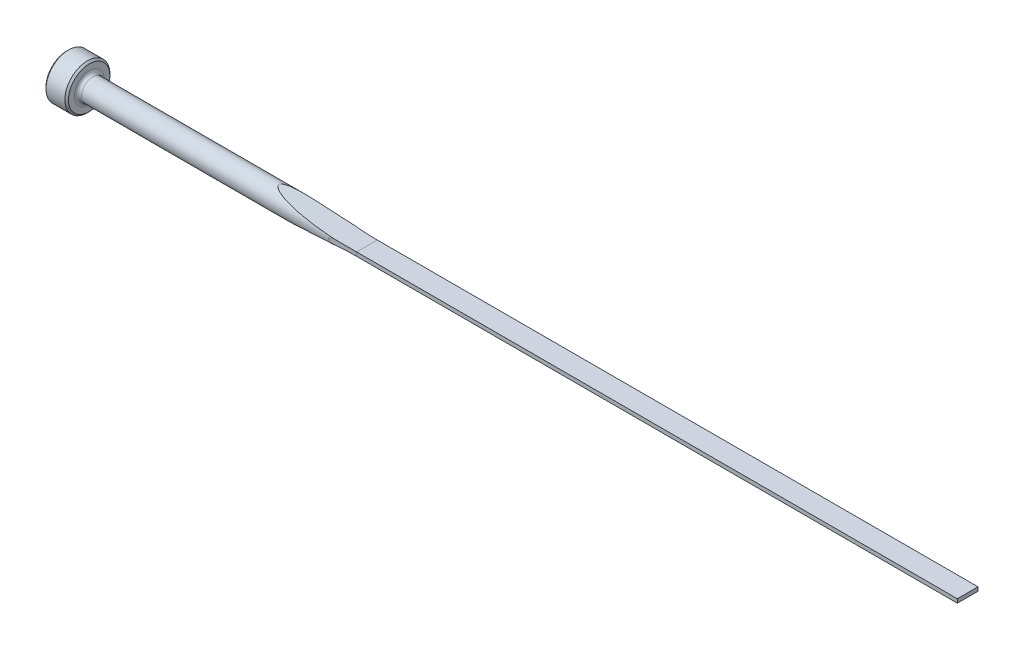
ISO-10303-21;
HEADER;
FILE_DESCRIPTION(('STEP AP214'),'2;1');
FILE_NAME('part.step','',(''),(''),'','','');
FILE_SCHEMA(('AUTOMOTIVE_DESIGN { 1 0 10303 214 1 1 1 1 }'));
ENDSEC;
DATA;
#1=APPLICATION_CONTEXT('core data for automotive mechanical design processes');
#2=APPLICATION_PROTOCOL_DEFINITION('international standard','automotive_design',2000,#1);
#3=PRODUCT_CONTEXT('',#1,'mechanical');
#4=PRODUCT('Part','Part','',(#3));
#5=PRODUCT_RELATED_PRODUCT_CATEGORY('part','',(#4));
#6=PRODUCT_DEFINITION_FORMATION('','',#4);
#7=PRODUCT_DEFINITION_CONTEXT('part definition',#1,'design');
#8=PRODUCT_DEFINITION('design','',#6,#7);
#9=PRODUCT_DEFINITION_SHAPE('','',#8);
#10=(LENGTH_UNIT() NAMED_UNIT(*) SI_UNIT(.MILLI.,.METRE.));
#11=(NAMED_UNIT(*) PLANE_ANGLE_UNIT() SI_UNIT($,.RADIAN.));
#12=(NAMED_UNIT(*) SI_UNIT($,.STERADIAN.) SOLID_ANGLE_UNIT());
#13=UNCERTAINTY_MEASURE_WITH_UNIT(LENGTH_MEASURE(1.E-05),#10,'distance_accuracy_value','');
#14=(GEOMETRIC_REPRESENTATION_CONTEXT(3) GLOBAL_UNCERTAINTY_ASSIGNED_CONTEXT((#13)) GLOBAL_UNIT_ASSIGNED_CONTEXT((#10,
#11,#12)) REPRESENTATION_CONTEXT('',''));
#15=CARTESIAN_POINT('',(0.,0.,0.));
#16=DIRECTION('',(0.,0.,1.));
#17=DIRECTION('',(1.,0.,0.));
#18=AXIS2_PLACEMENT_3D('',#15,#16,#17);
#19=CARTESIAN_POINT('',(0.,0.,0.));
#20=DIRECTION('',(-1.,0.,0.));
#21=DIRECTION('',(0.,0.,1.));
#22=AXIS2_PLACEMENT_3D('',#19,#20,#21);
#23=CYLINDRICAL_SURFACE('',#22,2.3749);
#24=CARTESIAN_POINT('',(5.5118,0.,0.));
#25=DIRECTION('',(-1.,0.,0.));
#26=DIRECTION('',(0.,0.,1.));
#27=AXIS2_PLACEMENT_3D('',#24,#25,#26);
#28=CIRCLE('',#27,2.3749);
#29=CARTESIAN_POINT('',(5.5118,0.,2.3749));
#30=VERTEX_POINT('',#29);
#31=EDGE_CURVE('E164',#30,#30,#28,.F.);
#32=ORIENTED_EDGE('',*,*,#31,.T.);
#33=EDGE_LOOP('',(#32));
#34=FACE_BOUND('',#33,.T.);
#35=CARTESIAN_POINT('',(63.5,0.931958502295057,2.18439999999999));
#36=CARTESIAN_POINT('',(63.3075515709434,0.931940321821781,2.18439976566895));
#37=CARTESIAN_POINT('',(63.1151013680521,0.930492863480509,2.18502490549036));
#38=CARTESIAN_POINT('',(62.7302234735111,0.92461137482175,2.18752450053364));
#39=CARTESIAN_POINT('',(62.5377957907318,0.920176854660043,2.18939916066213));
#40=CARTESIAN_POINT('',(62.1518341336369,0.908155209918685,2.19441218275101));
#41=CARTESIAN_POINT('',(61.9583008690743,0.900548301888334,2.19755847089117));
#42=CARTESIAN_POINT('',(61.5714442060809,0.881895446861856,2.20511052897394));
#43=CARTESIAN_POINT('',(61.3781207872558,0.870849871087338,2.20951616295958));
#44=CARTESIAN_POINT('',(60.9803005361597,0.844100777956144,2.21987943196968));
#45=CARTESIAN_POINT('',(60.7758212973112,0.828159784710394,2.2259136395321));
#46=CARTESIAN_POINT('',(60.3673129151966,0.791030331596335,2.23937732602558));
#47=CARTESIAN_POINT('',(60.1632839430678,0.769840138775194,2.24680726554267));
#48=CARTESIAN_POINT('',(59.75661740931,0.720830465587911,2.26301546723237));
#49=CARTESIAN_POINT('',(59.5539775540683,0.693029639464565,2.27178991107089));
#50=CARTESIAN_POINT('',(59.2512709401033,0.644172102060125,2.28592867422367));
#51=CARTESIAN_POINT('',(59.150603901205,0.626699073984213,2.29080303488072));
#52=CARTESIAN_POINT('',(58.9498678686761,0.588702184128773,2.30086330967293));
#53=CARTESIAN_POINT('',(58.8497987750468,0.568178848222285,2.30604917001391));
#54=CARTESIAN_POINT('',(58.7018199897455,0.534634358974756,2.31396676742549));
#55=CARTESIAN_POINT('',(58.6535509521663,0.523182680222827,2.3165891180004));
#56=CARTESIAN_POINT('',(58.5573085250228,0.499097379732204,2.32189592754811));
#57=CARTESIAN_POINT('',(58.5093351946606,0.486463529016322,2.32458039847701));
#58=CARTESIAN_POINT('',(58.3663526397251,0.446582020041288,2.33269738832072));
#59=CARTESIAN_POINT('',(58.2718724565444,0.417265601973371,2.33821536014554));
#60=CARTESIAN_POINT('',(58.1453639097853,0.370835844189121,2.34580058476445));
#61=CARTESIAN_POINT('',(58.1118331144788,0.357819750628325,2.34783049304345));
#62=CARTESIAN_POINT('',(58.0453758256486,0.330089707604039,2.35189084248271));
#63=CARTESIAN_POINT('',(58.01245087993,0.315371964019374,2.35392127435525));
#64=CARTESIAN_POINT('',(57.9466649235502,0.28318239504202,2.35801388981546));
#65=CARTESIAN_POINT('',(57.9138393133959,0.265637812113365,2.36007502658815));
#66=CARTESIAN_POINT('',(57.8503018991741,0.227094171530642,2.36409846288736));
#67=CARTESIAN_POINT('',(57.8195817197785,0.206110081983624,2.36606114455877));
#68=CARTESIAN_POINT('',(57.7807522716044,0.17363214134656,2.36855971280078));
#69=CARTESIAN_POINT('',(57.7706531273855,0.164553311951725,2.36921145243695));
#70=CARTESIAN_POINT('',(57.751335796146,0.145453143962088,2.3704611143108));
#71=CARTESIAN_POINT('',(57.7421190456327,0.135430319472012,2.3710589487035));
#72=CARTESIAN_POINT('',(57.7248924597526,0.114162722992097,2.372178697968));
#73=CARTESIAN_POINT('',(57.7168989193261,0.10290439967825,2.3726995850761));
#74=CARTESIAN_POINT('',(57.7029630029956,0.0791761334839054,2.37360916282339));
#75=CARTESIAN_POINT('',(57.6970130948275,0.0667108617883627,2.37399833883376));
#76=CARTESIAN_POINT('',(57.6895493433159,0.0451214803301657,2.37448695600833));
#77=CARTESIAN_POINT('',(57.687216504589,0.0362843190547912,2.37463982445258));
#78=CARTESIAN_POINT('',(57.684070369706,0.018342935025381,2.3748460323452));
#79=CARTESIAN_POINT('',(57.68325542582,0.00923901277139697,2.37489947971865));
#80=CARTESIAN_POINT('',(57.6832396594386,-0.00898512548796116,2.37490051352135));
#81=CARTESIAN_POINT('',(57.6840414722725,-0.0181053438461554,2.37484792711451));
#82=CARTESIAN_POINT('',(57.6871682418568,-0.0360804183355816,2.37464298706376));
#83=CARTESIAN_POINT('',(57.6894948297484,-0.0449349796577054,2.37449052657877));
#84=CARTESIAN_POINT('',(57.696426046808,-0.0650505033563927,2.37403676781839));
#85=CARTESIAN_POINT('',(57.7015301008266,-0.0761364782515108,2.37370288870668));
#86=CARTESIAN_POINT('',(57.7134090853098,-0.0973644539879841,2.37292722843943));
#87=CARTESIAN_POINT('',(57.720188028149,-0.10750410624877,2.37248518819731));
#88=CARTESIAN_POINT('',(57.7406526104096,-0.134467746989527,2.37115359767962));
#89=CARTESIAN_POINT('',(57.7555945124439,-0.150320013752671,2.37018436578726));
#90=CARTESIAN_POINT('',(57.7874630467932,-0.179846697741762,2.36812651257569));
#91=CARTESIAN_POINT('',(57.8043958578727,-0.193514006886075,2.36703752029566));
#92=CARTESIAN_POINT('',(57.8500057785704,-0.226993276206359,2.36411848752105));
#93=CARTESIAN_POINT('',(57.8796018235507,-0.245533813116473,2.36223795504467));
#94=CARTESIAN_POINT('',(57.9403493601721,-0.279898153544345,2.3584104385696));
#95=CARTESIAN_POINT('',(57.9715045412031,-0.295715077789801,2.35646330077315));
#96=CARTESIAN_POINT('',(58.0666093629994,-0.34041895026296,2.35057165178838));
#97=CARTESIAN_POINT('',(58.1319170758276,-0.366382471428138,2.34659497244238));
#98=CARTESIAN_POINT('',(58.2741782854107,-0.417382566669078,2.3380950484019));
#99=CARTESIAN_POINT('',(58.3513848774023,-0.441669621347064,2.33358126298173));
#100=CARTESIAN_POINT('',(58.506961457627,-0.486276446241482,2.32469268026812));
#101=CARTESIAN_POINT('',(58.5853319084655,-0.506594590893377,2.32031794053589));
#102=CARTESIAN_POINT('',(58.8218439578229,-0.563416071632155,2.30743335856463));
#103=CARTESIAN_POINT('',(58.9810064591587,-0.595665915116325,2.29918591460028));
#104=CARTESIAN_POINT('',(59.3005735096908,-0.653182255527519,2.28349651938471));
#105=CARTESIAN_POINT('',(59.46097818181,-0.678448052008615,2.27605464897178));
#106=CARTESIAN_POINT('',(59.7823165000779,-0.723854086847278,2.26202300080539));
#107=CARTESIAN_POINT('',(59.9432491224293,-0.744001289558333,2.25543207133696));
#108=CARTESIAN_POINT('',(60.3686966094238,-0.792003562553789,2.23917011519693));
#109=CARTESIAN_POINT('',(60.6336093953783,-0.816543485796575,2.23022625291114));
#110=CARTESIAN_POINT('',(61.1642384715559,-0.857758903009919,2.21469349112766));
#111=CARTESIAN_POINT('',(61.4299551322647,-0.874429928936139,2.20810593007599));
#112=CARTESIAN_POINT('',(61.9612705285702,-0.901186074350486,2.19732116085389));
#113=CARTESIAN_POINT('',(62.2268685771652,-0.911283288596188,2.19311956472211));
#114=CARTESIAN_POINT('',(62.7582486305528,-0.925643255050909,2.18709742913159));
#115=CARTESIAN_POINT('',(63.0240306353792,-0.929906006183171,2.18527689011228));
#116=CARTESIAN_POINT('',(63.3598826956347,-0.931763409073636,2.18448280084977));
#117=CARTESIAN_POINT('',(63.4299416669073,-0.931956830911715,2.18439997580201));
#118=CARTESIAN_POINT('',(63.5,-0.931958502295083,2.18439999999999));
#119=B_SPLINE_CURVE_WITH_KNOTS('',3,(#35,#36,#37,#38,#39,#40,#41,#42,#43,#44,#45,#46,#47,#48,
#49,#50,#51,#52,#53,#54,#55,#56,#57,#58,#59,#60,#61,#62,#63,#64,#65,#66,#67,#68,#69,#70,#71,#72,
#73,#74,#75,#76,#77,#78,#79,#80,#81,#82,#83,#84,#85,#86,#87,#88,#89,#90,#91,#92,#93,#94,#95,#96,
#97,#98,#99,#100,#101,#102,#103,#104,#105,#106,#107,#108,#109,#110,#111,#112,#113,#114,#115,
#116,#117,#118),.UNSPECIFIED.,.F.,.F.,(4,2,2,2,2,2,2,2,2,2,2,2,2,2,2,2,2,2,2,2,2,2,2,2,2,2,2,2,
2,2,2,2,2,2,2,2,2,2,2,2,2,4),(0.,0.577341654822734,1.15477801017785,1.73587049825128,
2.31690027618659,2.93240275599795,3.5481087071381,4.16209742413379,4.46893047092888,
4.77571068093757,4.9247288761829,5.07377599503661,5.37061535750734,5.47866452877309,
5.58695943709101,5.69870175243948,5.80997010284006,5.85071283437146,5.89152080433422,
5.93283229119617,5.97398983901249,6.00129967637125,6.02857985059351,6.05590452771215,
6.08325848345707,6.11967760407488,6.1561848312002,6.22123367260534,6.28649000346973,
6.39114062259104,6.49605180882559,6.70686384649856,6.94992813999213,7.19309177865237,
7.68061293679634,8.16818297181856,8.65508602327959,9.45349626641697,10.2523593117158,
11.0497483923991,11.8471376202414,12.0573140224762),.UNSPECIFIED.);
#120=CARTESIAN_POINT('',(58.7071074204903,0.535694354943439,2.31369435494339));
#121=VERTEX_POINT('',#120);
#122=CARTESIAN_POINT('',(58.7071074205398,-0.535694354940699,2.31369435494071));
#123=VERTEX_POINT('',#122);
#124=EDGE_CURVE('E167',#121,#123,#119,.T.);
#125=ORIENTED_EDGE('',*,*,#124,.F.);
#126=CARTESIAN_POINT('',(63.5,0.406400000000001,2.33986945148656));
#127=CARTESIAN_POINT('',(63.1044168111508,0.406399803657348,2.33984948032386));
#128=CARTESIAN_POINT('',(62.7088333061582,0.409040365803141,2.33941010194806));
#129=CARTESIAN_POINT('',(61.9177233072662,0.419601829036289,2.33754961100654));
#130=CARTESIAN_POINT('',(61.5221968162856,0.427522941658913,2.33612845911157));
#131=CARTESIAN_POINT('',(60.7304473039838,0.448666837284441,2.33215725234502));
#132=CARTESIAN_POINT('',(60.334224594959,0.46190088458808,2.32960479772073));
#133=CARTESIAN_POINT('',(59.5420171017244,0.493667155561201,2.32308149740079));
#134=CARTESIAN_POINT('',(59.1460323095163,0.512199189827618,2.31911070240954));
#135=CARTESIAN_POINT('',(58.3535202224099,0.554602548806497,2.30933764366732));
#136=CARTESIAN_POINT('',(57.9569935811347,0.578485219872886,2.30353147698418));
#137=CARTESIAN_POINT('',(57.1643370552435,0.631560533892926,2.28954911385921));
#138=CARTESIAN_POINT('',(56.7682071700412,0.660753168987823,2.28137292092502));
#139=CARTESIAN_POINT('',(55.9763063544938,0.724449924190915,2.26195322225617));
#140=CARTESIAN_POINT('',(55.5805356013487,0.758955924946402,2.25070862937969));
#141=CARTESIAN_POINT('',(54.7896269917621,0.833256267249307,2.22427297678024));
#142=CARTESIAN_POINT('',(54.3944891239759,0.873050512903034,2.20908198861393));
#143=CARTESIAN_POINT('',(53.6053195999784,0.957870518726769,2.17364869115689));
#144=CARTESIAN_POINT('',(53.2112873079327,1.00289202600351,2.15341047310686));
#145=CARTESIAN_POINT('',(52.4242497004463,1.09815278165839,2.10642646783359));
#146=CARTESIAN_POINT('',(52.0312443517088,1.14839185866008,2.07968089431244));
#147=CARTESIAN_POINT('',(51.2467997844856,1.25399752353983,2.01777261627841));
#148=CARTESIAN_POINT('',(50.8553597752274,1.30936105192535,1.98261491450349));
#149=CARTESIAN_POINT('',(50.2696668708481,1.39617734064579,1.92147807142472));
#150=CARTESIAN_POINT('',(50.0746928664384,1.42574258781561,1.89970073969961));
#151=CARTESIAN_POINT('',(49.6853329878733,1.48610747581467,1.85286228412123));
#152=CARTESIAN_POINT('',(49.490947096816,1.51690708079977,1.82780125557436));
#153=CARTESIAN_POINT('',(49.1027972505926,1.57972659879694,1.77379004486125));
#154=CARTESIAN_POINT('',(48.9090337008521,1.61174718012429,1.74483771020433));
#155=CARTESIAN_POINT('',(48.5224234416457,1.67694930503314,1.68227119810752));
#156=CARTESIAN_POINT('',(48.3295768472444,1.71013099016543,1.64865645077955));
#157=CARTESIAN_POINT('',(47.9454982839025,1.77751664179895,1.57576815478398));
#158=CARTESIAN_POINT('',(47.7542640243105,1.81171864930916,1.53650495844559));
#159=CARTESIAN_POINT('',(47.3736080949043,1.88107830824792,1.45077652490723));
#160=CARTESIAN_POINT('',(47.1841859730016,1.91623571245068,1.40431313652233));
#161=CARTESIAN_POINT('',(46.8545415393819,1.9785150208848,1.3144663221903));
#162=CARTESIAN_POINT('',(46.7137260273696,2.00547620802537,1.27315803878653));
#163=CARTESIAN_POINT('',(46.4340568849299,2.05971596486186,1.1834275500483));
#164=CARTESIAN_POINT('',(46.2952077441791,2.08699506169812,1.13499127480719));
#165=CARTESIAN_POINT('',(46.0903441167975,2.12774040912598,1.05533759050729));
#166=CARTESIAN_POINT('',(46.0229205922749,2.14123294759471,1.02775945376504));
#167=CARTESIAN_POINT('',(45.8893070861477,2.16812981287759,0.969737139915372));
#168=CARTESIAN_POINT('',(45.823116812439,2.1815341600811,0.939293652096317));
#169=CARTESIAN_POINT('',(45.6926184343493,2.20811308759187,0.874982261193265));
#170=CARTESIAN_POINT('',(45.6283052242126,2.22128824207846,0.84112503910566));
#171=CARTESIAN_POINT('',(45.5021420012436,2.24727503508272,0.76901230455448));
#172=CARTESIAN_POINT('',(45.4402897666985,2.2600869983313,0.7307608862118));
#173=CARTESIAN_POINT('',(45.3403180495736,2.28090012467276,0.662165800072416));
#174=CARTESIAN_POINT('',(45.3011456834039,2.28908441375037,0.633421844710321));
#175=CARTESIAN_POINT('',(45.2251269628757,2.30501770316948,0.572739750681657));
#176=CARTESIAN_POINT('',(45.1882839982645,2.31276606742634,0.540797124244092));
#177=CARTESIAN_POINT('',(45.1177924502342,2.32763389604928,0.472755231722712));
#178=CARTESIAN_POINT('',(45.0841755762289,2.33474707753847,0.436621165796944));
#179=CARTESIAN_POINT('',(45.022498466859,2.3478298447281,0.359666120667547));
#180=CARTESIAN_POINT('',(44.9944234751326,2.3538024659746,0.318858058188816));
#181=CARTESIAN_POINT('',(44.9557647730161,2.3620409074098,0.248316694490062));
#182=CARTESIAN_POINT('',(44.942557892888,2.36485947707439,0.22010198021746));
#183=CARTESIAN_POINT('',(44.9205811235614,2.36955326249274,0.161913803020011));
#184=CARTESIAN_POINT('',(44.9118054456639,2.37142970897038,0.131942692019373));
#185=CARTESIAN_POINT('',(44.8995504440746,2.37405090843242,0.0705758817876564));
#186=CARTESIAN_POINT('',(44.896118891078,2.3747854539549,0.0391698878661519));
#187=CARTESIAN_POINT('',(44.8951655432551,2.37498947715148,-0.0237379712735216));
#188=CARTESIAN_POINT('',(44.8976430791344,2.37445909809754,-0.0552398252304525));
#189=CARTESIAN_POINT('',(44.9076355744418,2.37232149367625,-0.114120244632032));
#190=CARTESIAN_POINT('',(44.9146229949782,2.37082704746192,-0.141596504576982));
#191=CARTESIAN_POINT('',(44.9324513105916,2.36701756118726,-0.195194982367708));
#192=CARTESIAN_POINT('',(44.9432944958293,2.36470203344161,-0.221316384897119));
#193=CARTESIAN_POINT('',(44.975995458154,2.35772732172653,-0.288121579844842));
#194=CARTESIAN_POINT('',(45.0004661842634,2.35251555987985,-0.327458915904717));
#195=CARTESIAN_POINT('',(45.0549219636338,2.34094780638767,-0.401925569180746));
#196=CARTESIAN_POINT('',(45.0849249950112,2.3345880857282,-0.437040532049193));
#197=CARTESIAN_POINT('',(45.1478725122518,2.32128385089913,-0.502883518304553));
#198=CARTESIAN_POINT('',(45.1807403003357,2.31435476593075,-0.533689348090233));
#199=CARTESIAN_POINT('',(45.2489037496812,2.30002838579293,-0.592395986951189));
#200=CARTESIAN_POINT('',(45.2842018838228,2.29263061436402,-0.620293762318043));
#201=CARTESIAN_POINT('',(45.3565971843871,2.27750649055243,-0.673710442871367));
#202=CARTESIAN_POINT('',(45.3936982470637,2.26977943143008,-0.699223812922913));
#203=CARTESIAN_POINT('',(45.4691612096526,2.25411491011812,-0.748180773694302));
#204=CARTESIAN_POINT('',(45.5075225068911,2.24617754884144,-0.771625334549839));
#205=CARTESIAN_POINT('',(45.6136713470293,2.22428956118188,-0.833316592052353));
#206=CARTESIAN_POINT('',(45.682434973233,2.2101921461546,-0.869829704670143));
#207=CARTESIAN_POINT('',(45.8219229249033,2.18177272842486,-0.938828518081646));
#208=CARTESIAN_POINT('',(45.8926484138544,2.16745059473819,-0.971311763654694));
#209=CARTESIAN_POINT('',(46.1071388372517,2.12429388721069,-1.06406057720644));
#210=CARTESIAN_POINT('',(46.2529626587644,2.0953216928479,-1.11948666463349));
#211=CARTESIAN_POINT('',(46.5483943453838,2.03741406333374,-1.22168715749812));
#212=CARTESIAN_POINT('',(46.6980180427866,2.00847961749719,-1.26841467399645));
#213=CARTESIAN_POINT('',(46.9238574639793,1.965416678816,-1.33339980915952));
#214=CARTESIAN_POINT('',(46.9993227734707,1.95112780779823,-1.35419888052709));
#215=CARTESIAN_POINT('',(47.1506704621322,1.92267524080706,-1.39430070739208));
#216=CARTESIAN_POINT('',(47.2265528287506,1.90851154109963,-1.41360350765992));
#217=CARTESIAN_POINT('',(47.4813454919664,1.86129873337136,-1.47605728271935));
#218=CARTESIAN_POINT('',(47.661048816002,1.82856748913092,-1.51622419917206));
#219=CARTESIAN_POINT('',(48.0218079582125,1.76401499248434,-1.59085660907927));
#220=CARTESIAN_POINT('',(48.2028640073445,1.73219390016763,-1.62532110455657));
#221=CARTESIAN_POINT('',(48.5660633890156,1.66952697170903,-1.68962914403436));
#222=CARTESIAN_POINT('',(48.7482072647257,1.63868168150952,-1.71947013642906));
#223=CARTESIAN_POINT('',(49.1132627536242,1.57803492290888,-1.77528798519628));
#224=CARTESIAN_POINT('',(49.2961744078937,1.54823351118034,-1.80126463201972));
#225=CARTESIAN_POINT('',(49.8467186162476,1.4603059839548,-1.87443797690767));
#226=CARTESIAN_POINT('',(50.2152663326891,1.40381094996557,-1.91672647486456));
#227=CARTESIAN_POINT('',(50.9538547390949,1.29535770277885,-1.99160931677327));
#228=CARTESIAN_POINT('',(51.3238949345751,1.24339809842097,-2.02420664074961));
#229=CARTESIAN_POINT('',(52.0651082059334,1.1440892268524,-2.08194780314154));
#230=CARTESIAN_POINT('',(52.4362811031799,1.0967392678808,-2.10709276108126));
#231=CARTESIAN_POINT('',(53.1795583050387,1.00669079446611,-2.15156688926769));
#232=CARTESIAN_POINT('',(53.551662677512,0.963992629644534,-2.17089562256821));
#233=CARTESIAN_POINT('',(54.296097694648,0.883336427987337,-2.20494434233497));
#234=CARTESIAN_POINT('',(54.6684274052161,0.84537225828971,-2.2196703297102));
#235=CARTESIAN_POINT('',(55.4136629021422,0.77413879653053,-2.24550424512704));
#236=CARTESIAN_POINT('',(55.7865686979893,0.740869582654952,-2.25661211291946));
#237=CARTESIAN_POINT('',(56.760012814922,0.660219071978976,-2.28188501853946));
#238=CARTESIAN_POINT('',(57.3609226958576,0.616576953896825,-2.29379434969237));
#239=CARTESIAN_POINT('',(58.5637415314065,0.541505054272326,-2.31266265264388));
#240=CARTESIAN_POINT('',(59.165650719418,0.510078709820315,-2.31962023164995));
#241=CARTESIAN_POINT('',(60.3692581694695,0.459504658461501,-2.33016558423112));
#242=CARTESIAN_POINT('',(60.9709557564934,0.440341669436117,-2.33375755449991));
#243=CARTESIAN_POINT('',(62.1746207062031,0.414242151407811,-2.33853166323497));
#244=CARTESIAN_POINT('',(62.7765880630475,0.407305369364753,-2.33971385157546));
#245=CARTESIAN_POINT('',(63.4190317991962,0.406427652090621,-2.3398645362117));
#246=CARTESIAN_POINT('',(63.459515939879,0.406399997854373,-2.3398693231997));
#247=CARTESIAN_POINT('',(63.5,0.406399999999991,-2.33986945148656));
#248=B_SPLINE_CURVE_WITH_KNOTS('',3,(#126,#127,#128,#129,#130,#131,#132,#133,#134,#135,#136,
#137,#138,#139,#140,#141,#142,#143,#144,#145,#146,#147,#148,#149,#150,#151,#152,#153,#154,#155,
#156,#157,#158,#159,#160,#161,#162,#163,#164,#165,#166,#167,#168,#169,#170,#171,#172,#173,#174,
#175,#176,#177,#178,#179,#180,#181,#182,#183,#184,#185,#186,#187,#188,#189,#190,#191,#192,#193,
#194,#195,#196,#197,#198,#199,#200,#201,#202,#203,#204,#205,#206,#207,#208,#209,#210,#211,#212,
#213,#214,#215,#216,#217,#218,#219,#220,#221,#222,#223,#224,#225,#226,#227,#228,#229,#230,#231,
#232,#233,#234,#235,#236,#237,#238,#239,#240,#241,#242,#243,#244,#245,#246,#247),.UNSPECIFIED.,
.F.,.F.,(4,2,2,2,2,2,2,2,2,2,2,2,2,2,2,2,2,2,2,2,2,2,2,2,2,2,2,2,2,2,2,2,2,2,2,2,2,2,2,2,2,2,2,
2,2,2,2,2,2,2,2,2,2,2,2,2,2,2,2,2,4),(0.,1.18674101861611,2.37352958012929,3.56284773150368,
4.75212337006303,5.94394522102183,7.13576530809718,8.32800820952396,9.52022949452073,
10.7114874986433,11.9027063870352,13.0932186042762,13.6883984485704,14.2835610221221,
14.8790541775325,15.4746201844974,16.0691082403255,16.6634438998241,17.1109425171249,
17.5593366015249,17.781541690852,18.0036934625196,18.2251705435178,18.4464429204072,
18.5941408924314,18.7420490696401,18.8912874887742,19.0401230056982,19.1336595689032,
19.2270736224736,19.3213179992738,19.4155517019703,19.5003787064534,19.5852561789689,
19.7243067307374,19.8638173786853,20.0003421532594,20.1370079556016,20.2739835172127,
20.4108945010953,20.6480705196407,20.8853903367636,21.3609114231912,21.838925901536,
22.077629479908,22.3163259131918,22.8772603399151,23.4382928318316,23.99963385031,
24.5610052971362,25.686505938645,26.8116601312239,27.9366452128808,29.0617147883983,
30.1853113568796,31.3089266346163,33.1165903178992,34.9247622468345,36.7306764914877,
38.5365533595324,38.658005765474),.UNSPECIFIED.);
#249=CARTESIAN_POINT('',(58.7071074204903,0.53569435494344,-2.31369435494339));
#250=VERTEX_POINT('',#249);
#251=EDGE_CURVE('E113',#121,#250,#248,.T.);
#252=ORIENTED_EDGE('',*,*,#251,.T.);
#253=CARTESIAN_POINT('',(63.5,0.931958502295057,-2.18439999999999));
#254=CARTESIAN_POINT('',(63.3075515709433,0.931940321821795,-2.18439976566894));
#255=CARTESIAN_POINT('',(63.115101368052,0.930492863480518,-2.18502490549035));
#256=CARTESIAN_POINT('',(62.7302234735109,0.924611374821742,-2.18752450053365));
#257=CARTESIAN_POINT('',(62.5377957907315,0.920176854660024,-2.18939916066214));
#258=CARTESIAN_POINT('',(62.1518341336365,0.908155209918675,-2.19441218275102));
#259=CARTESIAN_POINT('',(61.9583008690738,0.900548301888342,-2.19755847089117));
#260=CARTESIAN_POINT('',(61.5714442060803,0.881895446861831,-2.20511052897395));
#261=CARTESIAN_POINT('',(61.3781207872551,0.870849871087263,-2.20951616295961));
#262=CARTESIAN_POINT('',(60.980300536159,0.844100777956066,-2.21987943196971));
#263=CARTESIAN_POINT('',(60.7758212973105,0.828159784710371,-2.22591363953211));
#264=CARTESIAN_POINT('',(60.3673129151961,0.791030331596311,-2.23937732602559));
#265=CARTESIAN_POINT('',(60.1632839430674,0.769840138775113,-2.2468072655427));
#266=CARTESIAN_POINT('',(59.7566174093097,0.720830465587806,-2.26301546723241));
#267=CARTESIAN_POINT('',(59.5539775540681,0.693029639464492,-2.27178991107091));
#268=CARTESIAN_POINT('',(59.2512709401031,0.644172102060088,-2.28592867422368));
#269=CARTESIAN_POINT('',(59.1506039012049,0.626699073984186,-2.29080303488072));
#270=CARTESIAN_POINT('',(58.949867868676,0.588702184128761,-2.30086330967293));
#271=CARTESIAN_POINT('',(58.8497987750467,0.568178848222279,-2.30604917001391));
#272=CARTESIAN_POINT('',(58.7018199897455,0.534634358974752,-2.31396676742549));
#273=CARTESIAN_POINT('',(58.6535509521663,0.523182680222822,-2.31658911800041));
#274=CARTESIAN_POINT('',(58.5573085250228,0.499097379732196,-2.32189592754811));
#275=CARTESIAN_POINT('',(58.5093351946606,0.486463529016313,-2.32458039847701));
#276=CARTESIAN_POINT('',(58.3663526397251,0.446582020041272,-2.33269738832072));
#277=CARTESIAN_POINT('',(58.2718724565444,0.417265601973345,-2.33821536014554));
#278=CARTESIAN_POINT('',(58.1453639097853,0.370835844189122,-2.34580058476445));
#279=CARTESIAN_POINT('',(58.1118331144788,0.357819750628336,-2.34783049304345));
#280=CARTESIAN_POINT('',(58.0453758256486,0.330089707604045,-2.35189084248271));
#281=CARTESIAN_POINT('',(58.01245087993,0.315371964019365,-2.35392127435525));
#282=CARTESIAN_POINT('',(57.9466649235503,0.28318239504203,-2.35801388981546));
#283=CARTESIAN_POINT('',(57.9138393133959,0.265637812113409,-2.36007502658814));
#284=CARTESIAN_POINT('',(57.8503018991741,0.227094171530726,-2.36409846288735));
#285=CARTESIAN_POINT('',(57.8195817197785,0.206110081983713,-2.36606114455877));
#286=CARTESIAN_POINT('',(57.7807522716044,0.173632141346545,-2.36855971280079));
#287=CARTESIAN_POINT('',(57.7706531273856,0.164553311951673,-2.36921145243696));
#288=CARTESIAN_POINT('',(57.751335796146,0.145453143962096,-2.3704611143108));
#289=CARTESIAN_POINT('',(57.7421190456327,0.135430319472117,-2.37105894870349));
#290=CARTESIAN_POINT('',(57.7248924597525,0.114162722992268,-2.37217869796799));
#291=CARTESIAN_POINT('',(57.716898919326,0.102904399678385,-2.37269958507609));
#292=CARTESIAN_POINT('',(57.7029630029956,0.0791761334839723,-2.37360916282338));
#293=CARTESIAN_POINT('',(57.6970130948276,0.0667108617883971,-2.37399833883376));
#294=CARTESIAN_POINT('',(57.6895493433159,0.0451214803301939,-2.37448695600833));
#295=CARTESIAN_POINT('',(57.6872165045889,0.0362843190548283,-2.37463982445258));
#296=CARTESIAN_POINT('',(57.684070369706,0.0183429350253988,-2.3748460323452));
#297=CARTESIAN_POINT('',(57.6832554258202,0.00923901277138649,-2.37489947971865));
#298=CARTESIAN_POINT('',(57.6832396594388,-0.00898512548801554,-2.37490051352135));
#299=CARTESIAN_POINT('',(57.6840414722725,-0.0181053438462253,-2.37484792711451));
#300=CARTESIAN_POINT('',(57.6871682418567,-0.0360804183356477,-2.37464298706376));
#301=CARTESIAN_POINT('',(57.6894948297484,-0.0449349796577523,-2.37449052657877));
#302=CARTESIAN_POINT('',(57.6964260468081,-0.0650505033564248,-2.37403676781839));
#303=CARTESIAN_POINT('',(57.7015301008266,-0.0761364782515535,-2.37370288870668));
#304=CARTESIAN_POINT('',(57.7134090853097,-0.0973644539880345,-2.37292722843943));
#305=CARTESIAN_POINT('',(57.720188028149,-0.107504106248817,-2.3724851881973));
#306=CARTESIAN_POINT('',(57.7406526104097,-0.134467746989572,-2.37115359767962));
#307=CARTESIAN_POINT('',(57.755594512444,-0.15032001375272,-2.37018436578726));
#308=CARTESIAN_POINT('',(57.7874630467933,-0.179846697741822,-2.36812651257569));
#309=CARTESIAN_POINT('',(57.8043958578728,-0.193514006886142,-2.36703752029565));
#310=CARTESIAN_POINT('',(57.8500057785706,-0.226993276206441,-2.36411848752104));
#311=CARTESIAN_POINT('',(57.8796018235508,-0.245533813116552,-2.36223795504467));
#312=CARTESIAN_POINT('',(57.9403493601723,-0.279898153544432,-2.35841043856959));
#313=CARTESIAN_POINT('',(57.9715045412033,-0.295715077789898,-2.35646330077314));
#314=CARTESIAN_POINT('',(58.0666093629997,-0.340418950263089,-2.35057165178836));
#315=CARTESIAN_POINT('',(58.1319170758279,-0.36638247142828,-2.34659497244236));
#316=CARTESIAN_POINT('',(58.2741782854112,-0.41738256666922,-2.33809504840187));
#317=CARTESIAN_POINT('',(58.3513848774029,-0.441669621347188,-2.33358126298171));
#318=CARTESIAN_POINT('',(58.5069614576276,-0.486276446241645,-2.32469268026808));
#319=CARTESIAN_POINT('',(58.5853319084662,-0.506594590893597,-2.32031794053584));
#320=CARTESIAN_POINT('',(58.8218439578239,-0.563416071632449,-2.30743335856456));
#321=CARTESIAN_POINT('',(58.9810064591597,-0.595665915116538,-2.29918591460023));
#322=CARTESIAN_POINT('',(59.3005735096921,-0.653182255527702,-2.28349651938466));
#323=CARTESIAN_POINT('',(59.4609781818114,-0.678448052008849,-2.27605464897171));
#324=CARTESIAN_POINT('',(59.7823165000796,-0.723854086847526,-2.26202300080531));
#325=CARTESIAN_POINT('',(59.9432491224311,-0.744001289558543,-2.25543207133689));
#326=CARTESIAN_POINT('',(60.3686966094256,-0.792003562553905,-2.23917011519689));
#327=CARTESIAN_POINT('',(60.6336093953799,-0.816543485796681,-2.2302262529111));
#328=CARTESIAN_POINT('',(61.1642384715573,-0.857758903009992,-2.21469349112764));
#329=CARTESIAN_POINT('',(61.4299551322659,-0.874429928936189,-2.20810593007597));
#330=CARTESIAN_POINT('',(61.9612705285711,-0.901186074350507,-2.19732116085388));
#331=CARTESIAN_POINT('',(62.226868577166,-0.911283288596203,-2.1931195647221));
#332=CARTESIAN_POINT('',(62.7582486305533,-0.925643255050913,-2.18709742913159));
#333=CARTESIAN_POINT('',(63.0240306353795,-0.929906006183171,-2.18527689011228));
#334=CARTESIAN_POINT('',(63.3598826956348,-0.931763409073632,-2.18448280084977));
#335=CARTESIAN_POINT('',(63.4299416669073,-0.931956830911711,-2.18439997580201));
#336=CARTESIAN_POINT('',(63.5,-0.931958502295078,-2.18439999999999));
#337=B_SPLINE_CURVE_WITH_KNOTS('',3,(#253,#254,#255,#256,#257,#258,#259,#260,#261,#262,#263,
#264,#265,#266,#267,#268,#269,#270,#271,#272,#273,#274,#275,#276,#277,#278,#279,#280,#281,#282,
#283,#284,#285,#286,#287,#288,#289,#290,#291,#292,#293,#294,#295,#296,#297,#298,#299,#300,#301,
#302,#303,#304,#305,#306,#307,#308,#309,#310,#311,#312,#313,#314,#315,#316,#317,#318,#319,#320,
#321,#322,#323,#324,#325,#326,#327,#328,#329,#330,#331,#332,#333,#334,#335,#336),.UNSPECIFIED.,
.F.,.F.,(4,2,2,2,2,2,2,2,2,2,2,2,2,2,2,2,2,2,2,2,2,2,2,2,2,2,2,2,2,2,2,2,2,2,2,2,2,2,2,2,2,4),
(0.,0.577341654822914,1.15477801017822,1.73587049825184,2.31690027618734,2.9324027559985,
3.54810870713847,4.16209742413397,4.46893047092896,4.77571068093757,4.92472887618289,
5.0737759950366,5.37061535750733,5.47866452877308,5.58695943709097,5.69870175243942,
5.80997010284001,5.85071283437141,5.89152080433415,5.93283229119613,5.97398983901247,
6.00129967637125,6.02857985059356,6.05590452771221,6.08325848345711,6.11967760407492,
6.15618483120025,6.22123367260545,6.28649000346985,6.39114062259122,6.49605180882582,
6.70686384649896,6.94992813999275,7.19309177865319,7.68061293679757,8.16818297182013,
8.65508602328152,9.45349626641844,10.2523593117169,11.0497483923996,11.8471376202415,
12.0573140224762),.UNSPECIFIED.);
#338=CARTESIAN_POINT('',(58.7071074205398,-0.535694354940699,-2.31369435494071));
#339=VERTEX_POINT('',#338);
#340=EDGE_CURVE('E188',#250,#339,#337,.T.);
#341=ORIENTED_EDGE('',*,*,#340,.T.);
#342=CARTESIAN_POINT('',(63.5,-0.406400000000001,2.33986945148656));
#343=CARTESIAN_POINT('',(63.1044168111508,-0.406399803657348,2.33984948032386));
#344=CARTESIAN_POINT('',(62.7088333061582,-0.409040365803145,2.33941010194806));
#345=CARTESIAN_POINT('',(61.9177233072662,-0.419601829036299,2.33754961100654));
#346=CARTESIAN_POINT('',(61.5221968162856,-0.427522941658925,2.33612845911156));
#347=CARTESIAN_POINT('',(60.7304473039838,-0.448666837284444,2.33215725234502));
#348=CARTESIAN_POINT('',(60.334224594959,-0.461900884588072,2.32960479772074));
#349=CARTESIAN_POINT('',(59.5420171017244,-0.49366715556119,2.32308149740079));
#350=CARTESIAN_POINT('',(59.1460323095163,-0.512199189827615,2.31911070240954));
#351=CARTESIAN_POINT('',(58.3535202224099,-0.554602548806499,2.30933764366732));
#352=CARTESIAN_POINT('',(57.9569935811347,-0.578485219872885,2.30353147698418));
#353=CARTESIAN_POINT('',(57.1643370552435,-0.631560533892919,2.28954911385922));
#354=CARTESIAN_POINT('',(56.7682071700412,-0.660753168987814,2.28137292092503));
#355=CARTESIAN_POINT('',(55.9763063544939,-0.724449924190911,2.26195322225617));
#356=CARTESIAN_POINT('',(55.5805356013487,-0.758955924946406,2.25070862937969));
#357=CARTESIAN_POINT('',(54.7896269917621,-0.833256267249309,2.22427297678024));
#358=CARTESIAN_POINT('',(54.3944891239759,-0.873050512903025,2.20908198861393));
#359=CARTESIAN_POINT('',(53.6053195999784,-0.957870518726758,2.1736486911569));
#360=CARTESIAN_POINT('',(53.2112873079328,-1.00289202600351,2.15341047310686));
#361=CARTESIAN_POINT('',(52.4242497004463,-1.0981527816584,2.10642646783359));
#362=CARTESIAN_POINT('',(52.0312443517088,-1.14839185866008,2.07968089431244));
#363=CARTESIAN_POINT('',(51.2467997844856,-1.25399752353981,2.01777261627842));
#364=CARTESIAN_POINT('',(50.8553597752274,-1.30936105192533,1.98261491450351));
#365=CARTESIAN_POINT('',(50.2696668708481,-1.39617734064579,1.92147807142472));
#366=CARTESIAN_POINT('',(50.0746928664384,-1.42574258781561,1.89970073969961));
#367=CARTESIAN_POINT('',(49.6853329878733,-1.48610747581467,1.85286228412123));
#368=CARTESIAN_POINT('',(49.490947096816,-1.51690708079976,1.82780125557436));
#369=CARTESIAN_POINT('',(49.1027972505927,-1.57972659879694,1.77379004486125));
#370=CARTESIAN_POINT('',(48.9090337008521,-1.61174718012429,1.74483771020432));
#371=CARTESIAN_POINT('',(48.5224234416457,-1.67694930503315,1.68227119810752));
#372=CARTESIAN_POINT('',(48.3295768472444,-1.71013099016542,1.64865645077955));
#373=CARTESIAN_POINT('',(47.9454982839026,-1.77751664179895,1.57576815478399));
#374=CARTESIAN_POINT('',(47.7542640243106,-1.81171864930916,1.53650495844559));
#375=CARTESIAN_POINT('',(47.3736080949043,-1.88107830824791,1.45077652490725));
#376=CARTESIAN_POINT('',(47.1841859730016,-1.91623571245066,1.40431313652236));
#377=CARTESIAN_POINT('',(46.8545415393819,-1.97851502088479,1.31446632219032));
#378=CARTESIAN_POINT('',(46.7137260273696,-2.00547620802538,1.27315803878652));
#379=CARTESIAN_POINT('',(46.4340568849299,-2.05971596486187,1.18342755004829));
#380=CARTESIAN_POINT('',(46.2952077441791,-2.08699506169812,1.13499127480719));
#381=CARTESIAN_POINT('',(46.0903441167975,-2.12774040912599,1.05533759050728));
#382=CARTESIAN_POINT('',(46.0229205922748,-2.14123294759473,1.02775945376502));
#383=CARTESIAN_POINT('',(45.8893070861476,-2.16812981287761,0.96973713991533));
#384=CARTESIAN_POINT('',(45.8231168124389,-2.18153416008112,0.939293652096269));
#385=CARTESIAN_POINT('',(45.6926184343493,-2.20811308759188,0.874982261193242));
#386=CARTESIAN_POINT('',(45.6283052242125,-2.22128824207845,0.841125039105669));
#387=CARTESIAN_POINT('',(45.5021420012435,-2.24727503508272,0.769012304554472));
#388=CARTESIAN_POINT('',(45.4402897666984,-2.26008699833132,0.730760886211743));
#389=CARTESIAN_POINT('',(45.3403180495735,-2.28090012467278,0.662165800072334));
#390=CARTESIAN_POINT('',(45.3011456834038,-2.28908441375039,0.633421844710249));
#391=CARTESIAN_POINT('',(45.2251269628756,-2.30501770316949,0.572739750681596));
#392=CARTESIAN_POINT('',(45.1882839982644,-2.31276606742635,0.540797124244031));
#393=CARTESIAN_POINT('',(45.1177924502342,-2.32763389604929,0.472755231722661));
#394=CARTESIAN_POINT('',(45.0841755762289,-2.33474707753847,0.436621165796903));
#395=CARTESIAN_POINT('',(45.022498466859,-2.34782984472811,0.359666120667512));
#396=CARTESIAN_POINT('',(44.9944234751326,-2.3538024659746,0.318858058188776));
#397=CARTESIAN_POINT('',(44.9557647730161,-2.3620409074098,0.248316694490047));
#398=CARTESIAN_POINT('',(44.942557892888,-2.36485947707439,0.220101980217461));
#399=CARTESIAN_POINT('',(44.9205811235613,-2.36955326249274,0.161913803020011));
#400=CARTESIAN_POINT('',(44.9118054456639,-2.37142970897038,0.131942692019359));
#401=CARTESIAN_POINT('',(44.8995504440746,-2.37405090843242,0.0705758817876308));
#402=CARTESIAN_POINT('',(44.896118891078,-2.3747854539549,0.0391698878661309));
#403=CARTESIAN_POINT('',(44.8951655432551,-2.37498947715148,-0.0237379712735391));
#404=CARTESIAN_POINT('',(44.8976430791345,-2.37445909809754,-0.0552398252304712));
#405=CARTESIAN_POINT('',(44.9076355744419,-2.37232149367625,-0.11412024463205));
#406=CARTESIAN_POINT('',(44.9146229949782,-2.37082704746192,-0.141596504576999));
#407=CARTESIAN_POINT('',(44.9324513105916,-2.36701756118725,-0.195194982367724));
#408=CARTESIAN_POINT('',(44.9432944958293,-2.3647020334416,-0.221316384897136));
#409=CARTESIAN_POINT('',(44.975995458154,-2.35772732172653,-0.288121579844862));
#410=CARTESIAN_POINT('',(45.0004661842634,-2.35251555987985,-0.327458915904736));
#411=CARTESIAN_POINT('',(45.0549219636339,-2.34094780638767,-0.401925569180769));
#412=CARTESIAN_POINT('',(45.0849249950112,-2.33458808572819,-0.43704053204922));
#413=CARTESIAN_POINT('',(45.1478725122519,-2.32128385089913,-0.502883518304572));
#414=CARTESIAN_POINT('',(45.1807403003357,-2.31435476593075,-0.533689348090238));
#415=CARTESIAN_POINT('',(45.2489037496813,-2.30002838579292,-0.592395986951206));
#416=CARTESIAN_POINT('',(45.2842018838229,-2.29263061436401,-0.620293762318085));
#417=CARTESIAN_POINT('',(45.3565971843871,-2.27750649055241,-0.673710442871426));
#418=CARTESIAN_POINT('',(45.3936982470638,-2.26977943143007,-0.699223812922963));
#419=CARTESIAN_POINT('',(45.4691612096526,-2.25411491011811,-0.74818077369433));
#420=CARTESIAN_POINT('',(45.5075225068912,-2.24617754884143,-0.771625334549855));
#421=CARTESIAN_POINT('',(45.6136713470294,-2.22428956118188,-0.833316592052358));
#422=CARTESIAN_POINT('',(45.6824349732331,-2.21019214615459,-0.869829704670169));
#423=CARTESIAN_POINT('',(45.8219229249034,-2.18177272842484,-0.938828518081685));
#424=CARTESIAN_POINT('',(45.8926484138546,-2.16745059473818,-0.971311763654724));
#425=CARTESIAN_POINT('',(46.1071388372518,-2.12429388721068,-1.06406057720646));
#426=CARTESIAN_POINT('',(46.2529626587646,-2.09532169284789,-1.11948666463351));
#427=CARTESIAN_POINT('',(46.548394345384,-2.03741406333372,-1.22168715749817));
#428=CARTESIAN_POINT('',(46.6980180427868,-2.00847961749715,-1.26841467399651));
#429=CARTESIAN_POINT('',(46.9238574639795,-1.96541667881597,-1.33339980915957));
#430=CARTESIAN_POINT('',(46.9993227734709,-1.9511278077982,-1.35419888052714));
#431=CARTESIAN_POINT('',(47.1506704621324,-1.92267524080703,-1.39430070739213));
#432=CARTESIAN_POINT('',(47.2265528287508,-1.90851154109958,-1.41360350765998));
#433=CARTESIAN_POINT('',(47.4813454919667,-1.86129873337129,-1.47605728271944));
#434=CARTESIAN_POINT('',(47.6610488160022,-1.82856748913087,-1.51622419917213));
#435=CARTESIAN_POINT('',(48.0218079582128,-1.76401499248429,-1.59085660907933));
#436=CARTESIAN_POINT('',(48.2028640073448,-1.73219390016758,-1.62532110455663));
#437=CARTESIAN_POINT('',(48.566063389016,-1.66952697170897,-1.68962914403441));
#438=CARTESIAN_POINT('',(48.7482072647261,-1.63868168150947,-1.71947013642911));
#439=CARTESIAN_POINT('',(49.1132627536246,-1.57803492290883,-1.77528798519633));
#440=CARTESIAN_POINT('',(49.2961744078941,-1.54823351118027,-1.80126463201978));
#441=CARTESIAN_POINT('',(49.8467186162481,-1.46030598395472,-1.87443797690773));
#442=CARTESIAN_POINT('',(50.2152663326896,-1.40381094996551,-1.9167264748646));
#443=CARTESIAN_POINT('',(50.9538547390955,-1.29535770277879,-1.99160931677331));
#444=CARTESIAN_POINT('',(51.3238949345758,-1.24339809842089,-2.02420664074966));
#445=CARTESIAN_POINT('',(52.0651082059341,-1.14408922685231,-2.08194780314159));
#446=CARTESIAN_POINT('',(52.4362811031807,-1.09673926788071,-2.10709276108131));
#447=CARTESIAN_POINT('',(53.1795583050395,-1.00669079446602,-2.15156688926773));
#448=CARTESIAN_POINT('',(53.5516626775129,-0.963992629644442,-2.17089562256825));
#449=CARTESIAN_POINT('',(54.2960976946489,-0.883336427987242,-2.20494434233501));
#450=CARTESIAN_POINT('',(54.668427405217,-0.845372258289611,-2.21967032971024));
#451=CARTESIAN_POINT('',(55.4136629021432,-0.774138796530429,-2.24550424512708));
#452=CARTESIAN_POINT('',(55.7865686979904,-0.740869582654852,-2.2566121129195));
#453=CARTESIAN_POINT('',(56.7600128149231,-0.660219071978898,-2.28188501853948));
#454=CARTESIAN_POINT('',(57.3609226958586,-0.616576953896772,-2.29379434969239));
#455=CARTESIAN_POINT('',(58.5637415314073,-0.541505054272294,-2.31266265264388));
#456=CARTESIAN_POINT('',(59.1656507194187,-0.510078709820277,-2.31962023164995));
#457=CARTESIAN_POINT('',(60.36925816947,-0.459504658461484,-2.33016558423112));
#458=CARTESIAN_POINT('',(60.9709557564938,-0.440341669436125,-2.3337575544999));
#459=CARTESIAN_POINT('',(62.1746207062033,-0.414242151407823,-2.33853166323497));
#460=CARTESIAN_POINT('',(62.7765880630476,-0.407305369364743,-2.33971385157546));
#461=CARTESIAN_POINT('',(63.4190317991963,-0.40642765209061,-2.3398645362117));
#462=CARTESIAN_POINT('',(63.4595159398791,-0.406399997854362,-2.3398693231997));
#463=CARTESIAN_POINT('',(63.5,-0.406399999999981,-2.33986945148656));
#464=B_SPLINE_CURVE_WITH_KNOTS('',3,(#342,#343,#344,#345,#346,#347,#348,#349,#350,#351,#352,
#353,#354,#355,#356,#357,#358,#359,#360,#361,#362,#363,#364,#365,#366,#367,#368,#369,#370,#371,
#372,#373,#374,#375,#376,#377,#378,#379,#380,#381,#382,#383,#384,#385,#386,#387,#388,#389,#390,
#391,#392,#393,#394,#395,#396,#397,#398,#399,#400,#401,#402,#403,#404,#405,#406,#407,#408,#409,
#410,#411,#412,#413,#414,#415,#416,#417,#418,#419,#420,#421,#422,#423,#424,#425,#426,#427,#428,
#429,#430,#431,#432,#433,#434,#435,#436,#437,#438,#439,#440,#441,#442,#443,#444,#445,#446,#447,
#448,#449,#450,#451,#452,#453,#454,#455,#456,#457,#458,#459,#460,#461,#462,#463),.UNSPECIFIED.,
.F.,.F.,(4,2,2,2,2,2,2,2,2,2,2,2,2,2,2,2,2,2,2,2,2,2,2,2,2,2,2,2,2,2,2,2,2,2,2,2,2,2,2,2,2,2,2,
2,2,2,2,2,2,2,2,2,2,2,2,2,2,2,2,2,4),(0.,1.18674101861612,2.3735295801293,3.56284773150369,
4.75212337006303,5.94394522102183,7.13576530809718,8.32800820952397,9.52022949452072,
10.7114874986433,11.9027063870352,13.0932186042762,13.6883984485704,14.2835610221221,
14.8790541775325,15.4746201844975,16.0691082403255,16.6634438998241,17.1109425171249,
17.5593366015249,17.7815416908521,18.0036934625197,18.2251705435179,18.4464429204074,
18.5941408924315,18.7420490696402,18.8912874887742,19.0401230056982,19.1336595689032,
19.2270736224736,19.3213179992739,19.4155517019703,19.5003787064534,19.5852561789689,
19.7243067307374,19.8638173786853,20.0003421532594,20.1370079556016,20.2739835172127,
20.4108945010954,20.6480705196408,20.8853903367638,21.3609114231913,21.8389259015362,
22.0776294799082,22.316325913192,22.8772603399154,23.4382928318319,23.9996338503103,
24.5610052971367,25.6865059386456,26.8116601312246,27.9366452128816,29.0617147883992,
30.1853113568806,31.3089266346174,33.1165903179,34.9247622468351,36.730676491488,
38.5365533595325,38.658005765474),.UNSPECIFIED.);
#465=EDGE_CURVE('E112',#123,#339,#464,.T.);
#466=ORIENTED_EDGE('',*,*,#465,.F.);
#467=EDGE_LOOP('',(#125,#252,#341,#466));
#468=FACE_BOUND('',#467,.T.);
#469=ADVANCED_FACE('F36',(#34,#468),#23,.T.);
#470=CARTESIAN_POINT('',(190.5,2.3749,0.));
#471=DIRECTION('',(-1.,0.,0.));
#472=DIRECTION('',(0.,0.,1.));
#473=AXIS2_PLACEMENT_3D('',#470,#471,#472);
#474=PLANE('',#473);
#475=DIRECTION('',(0.,1.,0.));
#476=VECTOR('',#475,1.);
#477=CARTESIAN_POINT('',(190.5,-4.7625,2.1844));
#478=LINE('',#477,#476);
#479=CARTESIAN_POINT('',(190.5,-0.406400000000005,2.1844));
#480=VERTEX_POINT('',#479);
#481=CARTESIAN_POINT('',(190.5,0.406400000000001,2.1844));
#482=VERTEX_POINT('',#481);
#483=EDGE_CURVE('E91',#480,#482,#478,.T.);
#484=ORIENTED_EDGE('',*,*,#483,.F.);
#485=DIRECTION('',(0.,0.,1.));
#486=VECTOR('',#485,1.);
#487=CARTESIAN_POINT('',(190.5,-0.406400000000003,0.));
#488=LINE('',#487,#486);
#489=CARTESIAN_POINT('',(190.5,-0.406400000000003,-2.1844));
#490=VERTEX_POINT('',#489);
#491=EDGE_CURVE('E105',#490,#480,#488,.T.);
#492=ORIENTED_EDGE('',*,*,#491,.F.);
#493=DIRECTION('',(0.,1.,0.));
#494=VECTOR('',#493,1.);
#495=CARTESIAN_POINT('',(190.5,-4.7625,-2.1844));
#496=LINE('',#495,#494);
#497=CARTESIAN_POINT('',(190.5,0.406399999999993,-2.1844));
#498=VERTEX_POINT('',#497);
#499=EDGE_CURVE('E60',#490,#498,#496,.T.);
#500=ORIENTED_EDGE('',*,*,#499,.T.);
#501=DIRECTION('',(0.,0.,1.));
#502=VECTOR('',#501,1.);
#503=CARTESIAN_POINT('',(190.5,0.406400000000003,0.));
#504=LINE('',#503,#502);
#505=EDGE_CURVE('E107',#498,#482,#504,.T.);
#506=ORIENTED_EDGE('',*,*,#505,.T.);
#507=EDGE_LOOP('',(#484,#492,#500,#506));
#508=FACE_BOUND('',#507,.T.);
#509=ADVANCED_FACE('F104',(#508),#474,.F.);
#510=CARTESIAN_POINT('',(63.5,89.3064,-4.7625));
#511=DIRECTION('',(0.,0.,1.));
#512=DIRECTION('',(1.,0.,0.));
#513=AXIS2_PLACEMENT_3D('',#510,#511,#512);
#514=CYLINDRICAL_SURFACE('',#513,88.9);
#515=CARTESIAN_POINT('',(63.5,89.3064,91.0844));
#516=DIRECTION('',(0.,-0.707106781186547,0.707106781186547));
#517=DIRECTION('',(0.,0.707106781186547,0.707106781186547));
#518=AXIS2_PLACEMENT_3D('',#515,#516,#517);
#519=ELLIPSE('',#518,125.723585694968,88.9);
#520=CARTESIAN_POINT('',(63.5,0.406399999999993,2.18439999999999));
#521=VERTEX_POINT('',#520);
#522=EDGE_CURVE('E174',#521,#121,#519,.F.);
#523=ORIENTED_EDGE('',*,*,#522,.F.);
#524=DIRECTION('',(0.,0.,1.));
#525=VECTOR('',#524,1.);
#526=CARTESIAN_POINT('',(63.5,0.406399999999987,-4.7625));
#527=LINE('',#526,#525);
#528=CARTESIAN_POINT('',(63.5,0.406399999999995,-2.18439999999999));
#529=VERTEX_POINT('',#528);
#530=EDGE_CURVE('E182',#529,#521,#527,.T.);
#531=ORIENTED_EDGE('',*,*,#530,.F.);
#532=CARTESIAN_POINT('',(63.5,89.3064,-91.0844));
#533=DIRECTION('',(0.,0.707106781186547,0.707106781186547));
#534=DIRECTION('',(0.,-0.707106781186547,0.707106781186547));
#535=AXIS2_PLACEMENT_3D('',#532,#533,#534);
#536=ELLIPSE('',#535,125.723585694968,88.9);
#537=EDGE_CURVE('E181',#529,#250,#536,.F.);
#538=ORIENTED_EDGE('',*,*,#537,.T.);
#539=ORIENTED_EDGE('',*,*,#251,.F.);
#540=EDGE_LOOP('',(#523,#531,#538,#539));
#541=FACE_BOUND('',#540,.T.);
#542=ADVANCED_FACE('F149',(#541),#514,.F.);
#543=CARTESIAN_POINT('',(190.5,0.406400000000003,-4.7625));
#544=DIRECTION('',(0.,-1.,0.));
#545=DIRECTION('',(1.,0.,0.));
#546=AXIS2_PLACEMENT_3D('',#543,#544,#545);
#547=PLANE('',#546);
#548=DIRECTION('',(-1.,0.,0.));
#549=VECTOR('',#548,1.);
#550=CARTESIAN_POINT('',(190.5,0.406400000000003,2.1844));
#551=LINE('',#550,#549);
#552=EDGE_CURVE('E205',#482,#521,#551,.T.);
#553=ORIENTED_EDGE('',*,*,#552,.F.);
#554=ORIENTED_EDGE('',*,*,#505,.F.);
#555=DIRECTION('',(-1.,0.,0.));
#556=VECTOR('',#555,1.);
#557=CARTESIAN_POINT('',(190.5,0.406400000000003,-2.1844));
#558=LINE('',#557,#556);
#559=EDGE_CURVE('E187',#498,#529,#558,.T.);
#560=ORIENTED_EDGE('',*,*,#559,.T.);
#561=ORIENTED_EDGE('',*,*,#530,.T.);
#562=EDGE_LOOP('',(#553,#554,#560,#561));
#563=FACE_BOUND('',#562,.T.);
#564=ADVANCED_FACE('F140',(#563),#547,.F.);
#565=CARTESIAN_POINT('',(63.5,-89.3064,-4.7625));
#566=DIRECTION('',(0.,0.,1.));
#567=DIRECTION('',(1.,0.,0.));
#568=AXIS2_PLACEMENT_3D('',#565,#566,#567);
#569=CYLINDRICAL_SURFACE('',#568,88.9);
#570=DIRECTION('',(0.,0.,1.));
#571=VECTOR('',#570,1.);
#572=CARTESIAN_POINT('',(63.5,-0.406399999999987,-4.7625));
#573=LINE('',#572,#571);
#574=CARTESIAN_POINT('',(63.5,-0.4064,-2.18439999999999));
#575=VERTEX_POINT('',#574);
#576=CARTESIAN_POINT('',(63.5,-0.406399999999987,2.18439999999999));
#577=VERTEX_POINT('',#576);
#578=EDGE_CURVE('E193',#575,#577,#573,.T.);
#579=ORIENTED_EDGE('',*,*,#578,.T.);
#580=CARTESIAN_POINT('',(63.5,-89.3064,91.0844));
#581=DIRECTION('',(0.,0.707106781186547,0.707106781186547));
#582=DIRECTION('',(0.,-0.707106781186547,0.707106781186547));
#583=AXIS2_PLACEMENT_3D('',#580,#581,#582);
#584=ELLIPSE('',#583,125.723585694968,88.9);
#585=EDGE_CURVE('E175',#577,#123,#584,.T.);
#586=ORIENTED_EDGE('',*,*,#585,.T.);
#587=ORIENTED_EDGE('',*,*,#465,.T.);
#588=CARTESIAN_POINT('',(63.5,-89.3064,-91.0844));
#589=DIRECTION('',(0.,-0.707106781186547,0.707106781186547));
#590=DIRECTION('',(0.,0.707106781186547,0.707106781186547));
#591=AXIS2_PLACEMENT_3D('',#588,#589,#590);
#592=ELLIPSE('',#591,125.723585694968,88.9);
#593=EDGE_CURVE('E195',#575,#339,#592,.T.);
#594=ORIENTED_EDGE('',*,*,#593,.F.);
#595=EDGE_LOOP('',(#579,#586,#587,#594));
#596=FACE_BOUND('',#595,.T.);
#597=ADVANCED_FACE('F135',(#596),#569,.F.);
#598=CARTESIAN_POINT('',(190.5,-0.406400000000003,-4.7625));
#599=DIRECTION('',(0.,-1.,0.));
#600=DIRECTION('',(1.,0.,0.));
#601=AXIS2_PLACEMENT_3D('',#598,#599,#600);
#602=PLANE('',#601);
#603=ORIENTED_EDGE('',*,*,#491,.T.);
#604=DIRECTION('',(-1.,0.,0.));
#605=VECTOR('',#604,1.);
#606=CARTESIAN_POINT('',(190.5,-0.406400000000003,2.1844));
#607=LINE('',#606,#605);
#608=EDGE_CURVE('E88',#480,#577,#607,.T.);
#609=ORIENTED_EDGE('',*,*,#608,.T.);
#610=ORIENTED_EDGE('',*,*,#578,.F.);
#611=DIRECTION('',(-1.,0.,0.));
#612=VECTOR('',#611,1.);
#613=CARTESIAN_POINT('',(190.5,-0.406400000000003,-2.1844));
#614=LINE('',#613,#612);
#615=EDGE_CURVE('E99',#490,#575,#614,.T.);
#616=ORIENTED_EDGE('',*,*,#615,.F.);
#617=EDGE_LOOP('',(#603,#609,#610,#616));
#618=FACE_BOUND('',#617,.T.);
#619=ADVANCED_FACE('F110',(#618),#602,.T.);
#620=CARTESIAN_POINT('',(0.,0.,0.));
#621=DIRECTION('',(1.,0.,0.));
#622=DIRECTION('',(0.,0.,-1.));
#623=AXIS2_PLACEMENT_3D('',#620,#621,#622);
#624=PLANE('',#623);
#625=CARTESIAN_POINT('',(0.,0.,0.));
#626=DIRECTION('',(1.,0.,0.));
#627=DIRECTION('',(0.,0.,-1.));
#628=AXIS2_PLACEMENT_3D('',#625,#626,#627);
#629=CIRCLE('',#628,4.38150000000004);
#630=CARTESIAN_POINT('',(0.,0.,-4.38150000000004));
#631=VERTEX_POINT('',#630);
#632=EDGE_CURVE('E261',#631,#631,#629,.F.);
#633=ORIENTED_EDGE('',*,*,#632,.T.);
#634=EDGE_LOOP('',(#633));
#635=FACE_BOUND('',#634,.T.);
#636=ADVANCED_FACE('F147',(#635),#624,.F.);
#637=CARTESIAN_POINT('',(0.,0.,0.));
#638=DIRECTION('',(-1.,0.,0.));
#639=DIRECTION('',(0.,0.,1.));
#640=AXIS2_PLACEMENT_3D('',#637,#638,#639);
#641=CYLINDRICAL_SURFACE('',#640,4.7625);
#642=CARTESIAN_POINT('',(0.380999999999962,0.,0.));
#643=DIRECTION('',(1.,0.,0.));
#644=DIRECTION('',(0.,0.,-1.));
#645=AXIS2_PLACEMENT_3D('',#642,#643,#644);
#646=CIRCLE('',#645,4.7625);
#647=CARTESIAN_POINT('',(0.380999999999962,0.,-4.7625));
#648=VERTEX_POINT('',#647);
#649=EDGE_CURVE('E45',#648,#648,#646,.T.);
#650=ORIENTED_EDGE('',*,*,#649,.T.);
#651=EDGE_LOOP('',(#650));
#652=FACE_BOUND('',#651,.T.);
#653=CARTESIAN_POINT('',(4.36880000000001,0.,0.));
#654=DIRECTION('',(-1.,0.,0.));
#655=DIRECTION('',(0.,0.,1.));
#656=AXIS2_PLACEMENT_3D('',#653,#654,#655);
#657=CIRCLE('',#656,4.7625);
#658=CARTESIAN_POINT('',(4.36880000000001,0.,4.7625));
#659=VERTEX_POINT('',#658);
#660=EDGE_CURVE('E263',#659,#659,#657,.T.);
#661=ORIENTED_EDGE('',*,*,#660,.T.);
#662=EDGE_LOOP('',(#661));
#663=FACE_BOUND('',#662,.T.);
#664=ADVANCED_FACE('F235',(#652,#663),#641,.T.);
#665=CARTESIAN_POINT('',(4.7498,4.7625,0.));
#666=DIRECTION('',(-1.,0.,0.));
#667=DIRECTION('',(0.,0.,1.));
#668=AXIS2_PLACEMENT_3D('',#665,#666,#667);
#669=PLANE('',#668);
#670=CARTESIAN_POINT('',(4.7498,0.,0.));
#671=DIRECTION('',(-1.,0.,0.));
#672=DIRECTION('',(0.,0.,1.));
#673=AXIS2_PLACEMENT_3D('',#670,#671,#672);
#674=CIRCLE('',#673,4.38150000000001);
#675=CARTESIAN_POINT('',(4.7498,0.,4.38150000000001));
#676=VERTEX_POINT('',#675);
#677=EDGE_CURVE('E11',#676,#676,#674,.F.);
#678=ORIENTED_EDGE('',*,*,#677,.T.);
#679=EDGE_LOOP('',(#678));
#680=FACE_BOUND('',#679,.T.);
#681=CARTESIAN_POINT('',(4.7498,0.,0.));
#682=DIRECTION('',(-1.,0.,0.));
#683=DIRECTION('',(0.,0.,1.));
#684=AXIS2_PLACEMENT_3D('',#681,#682,#683);
#685=CIRCLE('',#684,3.1369);
#686=CARTESIAN_POINT('',(4.7498,0.,3.1369));
#687=VERTEX_POINT('',#686);
#688=EDGE_CURVE('E98',#687,#687,#685,.T.);
#689=ORIENTED_EDGE('',*,*,#688,.T.);
#690=EDGE_LOOP('',(#689));
#691=FACE_BOUND('',#690,.T.);
#692=ADVANCED_FACE('F230',(#680,#691),#669,.F.);
#693=CARTESIAN_POINT('',(190.5,-4.7625,-2.1844));
#694=DIRECTION('',(0.,0.,1.));
#695=DIRECTION('',(1.,0.,0.));
#696=AXIS2_PLACEMENT_3D('',#693,#694,#695);
#697=PLANE('',#696);
#698=ORIENTED_EDGE('',*,*,#499,.F.);
#699=ORIENTED_EDGE('',*,*,#615,.T.);
#700=DIRECTION('',(0.,1.,0.));
#701=VECTOR('',#700,1.);
#702=CARTESIAN_POINT('',(63.5,-4.7625,-2.18439999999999));
#703=LINE('',#702,#701);
#704=EDGE_CURVE('E207',#575,#529,#703,.T.);
#705=ORIENTED_EDGE('',*,*,#704,.T.);
#706=ORIENTED_EDGE('',*,*,#559,.F.);
#707=EDGE_LOOP('',(#698,#699,#705,#706));
#708=FACE_BOUND('',#707,.T.);
#709=ADVANCED_FACE('F206',(#708),#697,.F.);
#710=CARTESIAN_POINT('',(63.5,-4.7625,-91.0844));
#711=DIRECTION('',(0.,1.,0.));
#712=DIRECTION('',(0.,0.,1.));
#713=AXIS2_PLACEMENT_3D('',#710,#711,#712);
#714=CYLINDRICAL_SURFACE('',#713,88.9);
#715=ORIENTED_EDGE('',*,*,#704,.F.);
#716=ORIENTED_EDGE('',*,*,#593,.T.);
#717=ORIENTED_EDGE('',*,*,#340,.F.);
#718=ORIENTED_EDGE('',*,*,#537,.F.);
#719=EDGE_LOOP('',(#715,#716,#717,#718));
#720=FACE_BOUND('',#719,.T.);
#721=ADVANCED_FACE('F142',(#720),#714,.F.);
#722=CARTESIAN_POINT('',(63.5,-4.7625,91.0844));
#723=DIRECTION('',(0.,1.,0.));
#724=DIRECTION('',(0.,0.,1.));
#725=AXIS2_PLACEMENT_3D('',#722,#723,#724);
#726=CYLINDRICAL_SURFACE('',#725,88.9);
#727=ORIENTED_EDGE('',*,*,#522,.T.);
#728=ORIENTED_EDGE('',*,*,#124,.T.);
#729=ORIENTED_EDGE('',*,*,#585,.F.);
#730=DIRECTION('',(0.,1.,0.));
#731=VECTOR('',#730,1.);
#732=CARTESIAN_POINT('',(63.5,-4.7625,2.18439999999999));
#733=LINE('',#732,#731);
#734=EDGE_CURVE('E52',#577,#521,#733,.T.);
#735=ORIENTED_EDGE('',*,*,#734,.T.);
#736=EDGE_LOOP('',(#727,#728,#729,#735));
#737=FACE_BOUND('',#736,.T.);
#738=ADVANCED_FACE('F223',(#737),#726,.F.);
#739=CARTESIAN_POINT('',(190.5,-4.7625,2.1844));
#740=DIRECTION('',(0.,0.,1.));
#741=DIRECTION('',(1.,0.,0.));
#742=AXIS2_PLACEMENT_3D('',#739,#740,#741);
#743=PLANE('',#742);
#744=ORIENTED_EDGE('',*,*,#552,.T.);
#745=ORIENTED_EDGE('',*,*,#734,.F.);
#746=ORIENTED_EDGE('',*,*,#608,.F.);
#747=ORIENTED_EDGE('',*,*,#483,.T.);
#748=EDGE_LOOP('',(#744,#745,#746,#747));
#749=FACE_BOUND('',#748,.T.);
#750=ADVANCED_FACE('F90',(#749),#743,.T.);
#751=CARTESIAN_POINT('',(5.5118,0.,0.));
#752=DIRECTION('',(-1.,0.,0.));
#753=DIRECTION('',(0.,0.,1.));
#754=AXIS2_PLACEMENT_3D('',#751,#752,#753);
#755=TOROIDAL_SURFACE('',#754,3.1369,0.762);
#756=ORIENTED_EDGE('',*,*,#31,.F.);
#757=EDGE_LOOP('',(#756));
#758=FACE_BOUND('',#757,.T.);
#759=ORIENTED_EDGE('',*,*,#688,.F.);
#760=EDGE_LOOP('',(#759));
#761=FACE_BOUND('',#760,.T.);
#762=ADVANCED_FACE('F228',(#758,#761),#755,.F.);
#763=CARTESIAN_POINT('',(0.,0.,0.));
#764=DIRECTION('',(1.,0.,0.));
#765=DIRECTION('',(0.,0.,-1.));
#766=AXIS2_PLACEMENT_3D('',#763,#764,#765);
#767=CONICAL_SURFACE('',#766,4.38150000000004,0.785398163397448);
#768=ORIENTED_EDGE('',*,*,#649,.F.);
#769=EDGE_LOOP('',(#768));
#770=FACE_BOUND('',#769,.T.);
#771=ORIENTED_EDGE('',*,*,#632,.F.);
#772=EDGE_LOOP('',(#771));
#773=FACE_BOUND('',#772,.T.);
#774=ADVANCED_FACE('F248',(#770,#773),#767,.T.);
#775=CARTESIAN_POINT('',(4.36880000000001,0.,0.));
#776=DIRECTION('',(-1.,0.,0.));
#777=DIRECTION('',(0.,0.,1.));
#778=AXIS2_PLACEMENT_3D('',#775,#776,#777);
#779=CONICAL_SURFACE('',#778,4.7625,0.785398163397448);
#780=ORIENTED_EDGE('',*,*,#677,.F.);
#781=EDGE_LOOP('',(#780));
#782=FACE_BOUND('',#781,.T.);
#783=ORIENTED_EDGE('',*,*,#660,.F.);
#784=EDGE_LOOP('',(#783));
#785=FACE_BOUND('',#784,.T.);
#786=ADVANCED_FACE('F38',(#782,#785),#779,.T.);
#787=CLOSED_SHELL('',(#469,#509,#542,#564,#597,#619,#636,#664,#692,#709,#721,#738,#750,#762,
#774,#786));
#788=MANIFOLD_SOLID_BREP('B2',#787);
#789=ADVANCED_BREP_SHAPE_REPRESENTATION('',(#18,#788),#14);
#790=SHAPE_DEFINITION_REPRESENTATION(#9,#789);
ENDSEC;
END-ISO-10303-21;
